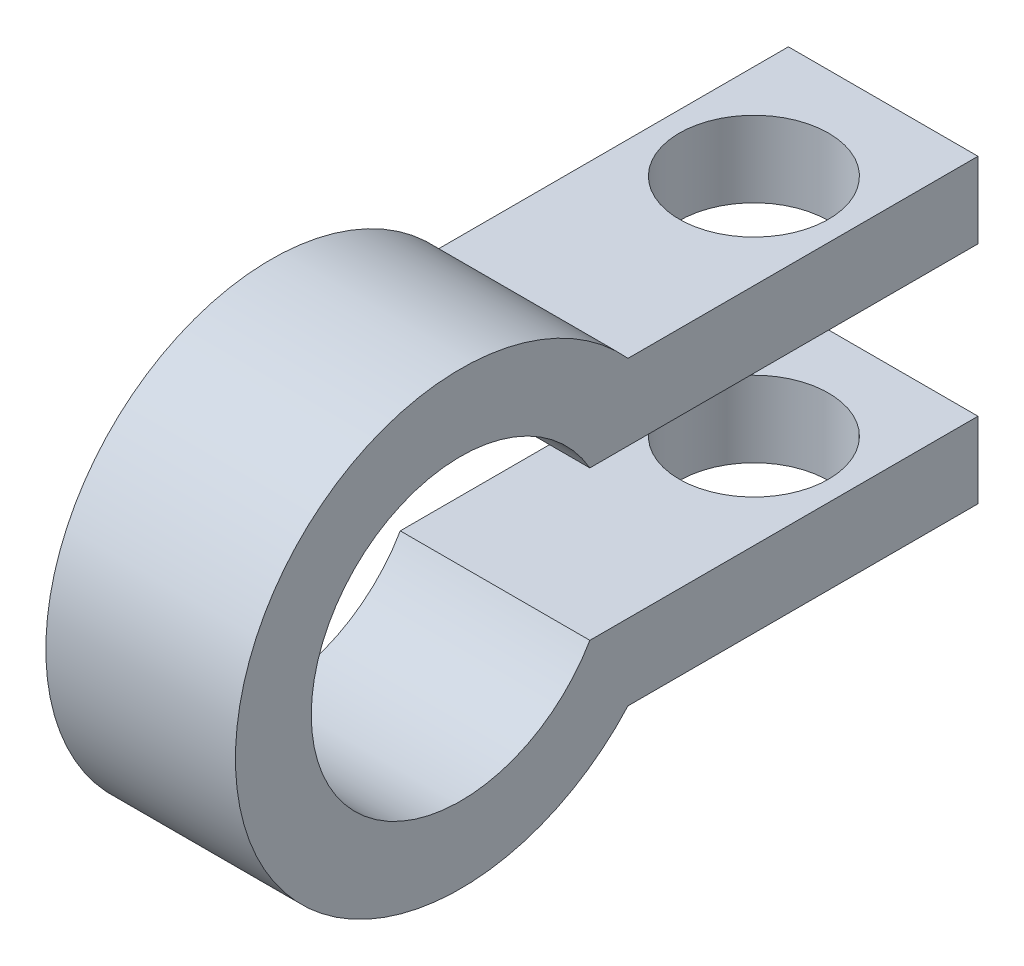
ISO-10303-21;
HEADER;
FILE_DESCRIPTION(('STEP AP214'),'2;1');
FILE_NAME('part.step','',(''),(''),'','','');
FILE_SCHEMA(('AUTOMOTIVE_DESIGN { 1 0 10303 214 1 1 1 1 }'));
ENDSEC;
DATA;
#1=APPLICATION_CONTEXT('core data for automotive mechanical design processes');
#2=APPLICATION_PROTOCOL_DEFINITION('international standard','automotive_design',2000,#1);
#3=PRODUCT_CONTEXT('',#1,'mechanical');
#4=PRODUCT('Part','Part','',(#3));
#5=PRODUCT_RELATED_PRODUCT_CATEGORY('part','',(#4));
#6=PRODUCT_DEFINITION_FORMATION('','',#4);
#7=PRODUCT_DEFINITION_CONTEXT('part definition',#1,'design');
#8=PRODUCT_DEFINITION('design','',#6,#7);
#9=PRODUCT_DEFINITION_SHAPE('','',#8);
#10=(LENGTH_UNIT() NAMED_UNIT(*) SI_UNIT(.MILLI.,.METRE.));
#11=(NAMED_UNIT(*) PLANE_ANGLE_UNIT() SI_UNIT($,.RADIAN.));
#12=(NAMED_UNIT(*) SI_UNIT($,.STERADIAN.) SOLID_ANGLE_UNIT());
#13=UNCERTAINTY_MEASURE_WITH_UNIT(LENGTH_MEASURE(1.E-05),#10,'distance_accuracy_value','');
#14=(GEOMETRIC_REPRESENTATION_CONTEXT(3) GLOBAL_UNCERTAINTY_ASSIGNED_CONTEXT((#13)) GLOBAL_UNIT_ASSIGNED_CONTEXT((#10,
#11,#12)) REPRESENTATION_CONTEXT('',''));
#15=CARTESIAN_POINT('',(0.,0.,0.));
#16=DIRECTION('',(0.,0.,1.));
#17=DIRECTION('',(1.,0.,0.));
#18=AXIS2_PLACEMENT_3D('',#15,#16,#17);
#19=CARTESIAN_POINT('',(3.175,-5.04,-4.33012701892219));
#20=DIRECTION('',(0.,1.,0.));
#21=DIRECTION('',(0.,0.,1.));
#22=AXIS2_PLACEMENT_3D('',#19,#20,#21);
#23=PLANE('',#22);
#24=CARTESIAN_POINT('',(0.,-5.04,-13.));
#25=DIRECTION('',(0.,1.,0.));
#26=DIRECTION('',(0.,0.,1.));
#27=AXIS2_PLACEMENT_3D('',#24,#25,#26);
#28=CIRCLE('',#27,2.5);
#29=CARTESIAN_POINT('',(0.,-5.04,-10.5));
#30=VERTEX_POINT('',#29);
#31=EDGE_CURVE('E134',#30,#30,#28,.T.);
#32=ORIENTED_EDGE('',*,*,#31,.T.);
#33=EDGE_LOOP('',(#32));
#34=FACE_BOUND('',#33,.T.);
#35=DIRECTION('',(0.,0.,-1.));
#36=VECTOR('',#35,1.);
#37=CARTESIAN_POINT('',(-3.175,-5.04,-4.33012701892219));
#38=LINE('',#37,#36);
#39=CARTESIAN_POINT('',(-3.175,-5.04,-5.60802995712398));
#40=VERTEX_POINT('',#39);
#41=CARTESIAN_POINT('',(-3.175,-5.04,-17.3301270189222));
#42=VERTEX_POINT('',#41);
#43=EDGE_CURVE('E130',#40,#42,#38,.T.);
#44=ORIENTED_EDGE('',*,*,#43,.T.);
#45=DIRECTION('',(-1.,0.,0.));
#46=VECTOR('',#45,1.);
#47=CARTESIAN_POINT('',(3.175,-5.04,-17.3301270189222));
#48=LINE('',#47,#46);
#49=CARTESIAN_POINT('',(3.175,-5.04,-17.3301270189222));
#50=VERTEX_POINT('',#49);
#51=EDGE_CURVE('E11',#50,#42,#48,.T.);
#52=ORIENTED_EDGE('',*,*,#51,.F.);
#53=DIRECTION('',(0.,0.,-1.));
#54=VECTOR('',#53,1.);
#55=CARTESIAN_POINT('',(3.175,-5.04,-4.33012701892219));
#56=LINE('',#55,#54);
#57=CARTESIAN_POINT('',(3.175,-5.04,-5.60802995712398));
#58=VERTEX_POINT('',#57);
#59=EDGE_CURVE('E88',#58,#50,#56,.T.);
#60=ORIENTED_EDGE('',*,*,#59,.F.);
#61=DIRECTION('',(-1.,0.,0.));
#62=VECTOR('',#61,1.);
#63=CARTESIAN_POINT('',(3.175,-5.04,-5.60802995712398));
#64=LINE('',#63,#62);
#65=EDGE_CURVE('E129',#58,#40,#64,.T.);
#66=ORIENTED_EDGE('',*,*,#65,.T.);
#67=EDGE_LOOP('',(#44,#52,#60,#66));
#68=FACE_BOUND('',#67,.T.);
#69=ADVANCED_FACE('F32',(#34,#68),#23,.F.);
#70=CARTESIAN_POINT('',(3.175,-2.5,-17.3301270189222));
#71=DIRECTION('',(0.,0.,-1.));
#72=DIRECTION('',(-1.,0.,0.));
#73=AXIS2_PLACEMENT_3D('',#70,#71,#72);
#74=PLANE('',#73);
#75=DIRECTION('',(0.,-1.,0.));
#76=VECTOR('',#75,1.);
#77=CARTESIAN_POINT('',(-3.175,-2.5,-17.3301270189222));
#78=LINE('',#77,#76);
#79=CARTESIAN_POINT('',(-3.175,-2.5,-17.3301270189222));
#80=VERTEX_POINT('',#79);
#81=EDGE_CURVE('E133',#80,#42,#78,.T.);
#82=ORIENTED_EDGE('',*,*,#81,.F.);
#83=DIRECTION('',(-1.,0.,0.));
#84=VECTOR('',#83,1.);
#85=CARTESIAN_POINT('',(3.175,-2.5,-17.3301270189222));
#86=LINE('',#85,#84);
#87=CARTESIAN_POINT('',(3.175,-2.5,-17.3301270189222));
#88=VERTEX_POINT('',#87);
#89=EDGE_CURVE('E41',#88,#80,#86,.T.);
#90=ORIENTED_EDGE('',*,*,#89,.F.);
#91=DIRECTION('',(0.,-1.,0.));
#92=VECTOR('',#91,1.);
#93=CARTESIAN_POINT('',(3.175,-2.5,-17.3301270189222));
#94=LINE('',#93,#92);
#95=EDGE_CURVE('E174',#88,#50,#94,.T.);
#96=ORIENTED_EDGE('',*,*,#95,.T.);
#97=ORIENTED_EDGE('',*,*,#51,.T.);
#98=EDGE_LOOP('',(#82,#90,#96,#97));
#99=FACE_BOUND('',#98,.T.);
#100=ADVANCED_FACE('F165',(#99),#74,.T.);
#101=CARTESIAN_POINT('',(3.175,-2.5,-4.33012701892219));
#102=DIRECTION('',(0.,1.,0.));
#103=DIRECTION('',(0.,0.,1.));
#104=AXIS2_PLACEMENT_3D('',#101,#102,#103);
#105=PLANE('',#104);
#106=CARTESIAN_POINT('',(0.,-2.5,-13.));
#107=DIRECTION('',(0.,1.,0.));
#108=DIRECTION('',(0.,0.,1.));
#109=AXIS2_PLACEMENT_3D('',#106,#107,#108);
#110=CIRCLE('',#109,2.5);
#111=CARTESIAN_POINT('',(0.,-2.5,-10.5));
#112=VERTEX_POINT('',#111);
#113=EDGE_CURVE('E181',#112,#112,#110,.T.);
#114=ORIENTED_EDGE('',*,*,#113,.F.);
#115=EDGE_LOOP('',(#114));
#116=FACE_BOUND('',#115,.T.);
#117=DIRECTION('',(0.,0.,-1.));
#118=VECTOR('',#117,1.);
#119=CARTESIAN_POINT('',(-3.175,-2.5,-4.33012701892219));
#120=LINE('',#119,#118);
#121=CARTESIAN_POINT('',(-3.175,-2.5,-4.33012701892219));
#122=VERTEX_POINT('',#121);
#123=EDGE_CURVE('E137',#122,#80,#120,.T.);
#124=ORIENTED_EDGE('',*,*,#123,.F.);
#125=DIRECTION('',(-1.,0.,0.));
#126=VECTOR('',#125,1.);
#127=CARTESIAN_POINT('',(3.175,-2.5,-4.33012701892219));
#128=LINE('',#127,#126);
#129=CARTESIAN_POINT('',(3.175,-2.5,-4.33012701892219));
#130=VERTEX_POINT('',#129);
#131=EDGE_CURVE('E154',#130,#122,#128,.T.);
#132=ORIENTED_EDGE('',*,*,#131,.F.);
#133=DIRECTION('',(0.,0.,-1.));
#134=VECTOR('',#133,1.);
#135=CARTESIAN_POINT('',(3.175,-2.5,-4.33012701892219));
#136=LINE('',#135,#134);
#137=EDGE_CURVE('E162',#130,#88,#136,.T.);
#138=ORIENTED_EDGE('',*,*,#137,.T.);
#139=ORIENTED_EDGE('',*,*,#89,.T.);
#140=EDGE_LOOP('',(#124,#132,#138,#139));
#141=FACE_BOUND('',#140,.T.);
#142=ADVANCED_FACE('F160',(#116,#141),#105,.T.);
#143=CARTESIAN_POINT('',(3.175,0.,0.));
#144=DIRECTION('',(-1.,0.,0.));
#145=DIRECTION('',(0.,0.,1.));
#146=AXIS2_PLACEMENT_3D('',#143,#144,#145);
#147=CYLINDRICAL_SURFACE('',#146,5.);
#148=CARTESIAN_POINT('',(-3.175,0.,0.));
#149=DIRECTION('',(1.,0.,0.));
#150=DIRECTION('',(0.,0.,-1.));
#151=AXIS2_PLACEMENT_3D('',#148,#149,#150);
#152=CIRCLE('',#151,5.);
#153=CARTESIAN_POINT('',(-3.175,2.5,-4.33012701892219));
#154=VERTEX_POINT('',#153);
#155=EDGE_CURVE('E140',#154,#122,#152,.T.);
#156=ORIENTED_EDGE('',*,*,#155,.F.);
#157=DIRECTION('',(-1.,0.,0.));
#158=VECTOR('',#157,1.);
#159=CARTESIAN_POINT('',(3.175,2.5,-4.33012701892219));
#160=LINE('',#159,#158);
#161=CARTESIAN_POINT('',(3.175,2.5,-4.33012701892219));
#162=VERTEX_POINT('',#161);
#163=EDGE_CURVE('E152',#162,#154,#160,.T.);
#164=ORIENTED_EDGE('',*,*,#163,.F.);
#165=CARTESIAN_POINT('',(3.175,0.,0.));
#166=DIRECTION('',(1.,0.,0.));
#167=DIRECTION('',(0.,0.,-1.));
#168=AXIS2_PLACEMENT_3D('',#165,#166,#167);
#169=CIRCLE('',#168,5.);
#170=EDGE_CURVE('E124',#162,#130,#169,.T.);
#171=ORIENTED_EDGE('',*,*,#170,.T.);
#172=ORIENTED_EDGE('',*,*,#131,.T.);
#173=EDGE_LOOP('',(#156,#164,#171,#172));
#174=FACE_BOUND('',#173,.T.);
#175=ADVANCED_FACE('F172',(#174),#147,.F.);
#176=CARTESIAN_POINT('',(3.175,2.5,-4.33012701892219));
#177=DIRECTION('',(0.,-1.,0.));
#178=DIRECTION('',(0.,0.,-1.));
#179=AXIS2_PLACEMENT_3D('',#176,#177,#178);
#180=PLANE('',#179);
#181=CARTESIAN_POINT('',(0.,2.5,-13.));
#182=DIRECTION('',(0.,-1.,0.));
#183=DIRECTION('',(0.,0.,-1.));
#184=AXIS2_PLACEMENT_3D('',#181,#182,#183);
#185=CIRCLE('',#184,2.5);
#186=CARTESIAN_POINT('',(0.,2.5,-15.5));
#187=VERTEX_POINT('',#186);
#188=EDGE_CURVE('E184',#187,#187,#185,.T.);
#189=ORIENTED_EDGE('',*,*,#188,.F.);
#190=EDGE_LOOP('',(#189));
#191=FACE_BOUND('',#190,.T.);
#192=DIRECTION('',(0.,0.,1.));
#193=VECTOR('',#192,1.);
#194=CARTESIAN_POINT('',(-3.175,2.5,-4.33012701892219));
#195=LINE('',#194,#193);
#196=CARTESIAN_POINT('',(-3.175,2.5,-17.3301270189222));
#197=VERTEX_POINT('',#196);
#198=EDGE_CURVE('E143',#197,#154,#195,.T.);
#199=ORIENTED_EDGE('',*,*,#198,.F.);
#200=DIRECTION('',(-1.,0.,0.));
#201=VECTOR('',#200,1.);
#202=CARTESIAN_POINT('',(3.175,2.5,-17.3301270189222));
#203=LINE('',#202,#201);
#204=CARTESIAN_POINT('',(3.175,2.5,-17.3301270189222));
#205=VERTEX_POINT('',#204);
#206=EDGE_CURVE('E112',#205,#197,#203,.T.);
#207=ORIENTED_EDGE('',*,*,#206,.F.);
#208=DIRECTION('',(0.,0.,1.));
#209=VECTOR('',#208,1.);
#210=CARTESIAN_POINT('',(3.175,2.5,-4.33012701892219));
#211=LINE('',#210,#209);
#212=EDGE_CURVE('E122',#205,#162,#211,.T.);
#213=ORIENTED_EDGE('',*,*,#212,.T.);
#214=ORIENTED_EDGE('',*,*,#163,.T.);
#215=EDGE_LOOP('',(#199,#207,#213,#214));
#216=FACE_BOUND('',#215,.T.);
#217=ADVANCED_FACE('F221',(#191,#216),#180,.T.);
#218=CARTESIAN_POINT('',(3.175,5.04,-17.3301270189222));
#219=DIRECTION('',(0.,0.,-1.));
#220=DIRECTION('',(-1.,0.,0.));
#221=AXIS2_PLACEMENT_3D('',#218,#219,#220);
#222=PLANE('',#221);
#223=DIRECTION('',(0.,-1.,0.));
#224=VECTOR('',#223,1.);
#225=CARTESIAN_POINT('',(-3.175,5.04,-17.3301270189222));
#226=LINE('',#225,#224);
#227=CARTESIAN_POINT('',(-3.175,5.04,-17.3301270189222));
#228=VERTEX_POINT('',#227);
#229=EDGE_CURVE('E111',#228,#197,#226,.T.);
#230=ORIENTED_EDGE('',*,*,#229,.F.);
#231=DIRECTION('',(-1.,0.,0.));
#232=VECTOR('',#231,1.);
#233=CARTESIAN_POINT('',(3.175,5.04,-17.3301270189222));
#234=LINE('',#233,#232);
#235=CARTESIAN_POINT('',(3.175,5.04,-17.3301270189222));
#236=VERTEX_POINT('',#235);
#237=EDGE_CURVE('E105',#236,#228,#234,.T.);
#238=ORIENTED_EDGE('',*,*,#237,.F.);
#239=DIRECTION('',(0.,-1.,0.));
#240=VECTOR('',#239,1.);
#241=CARTESIAN_POINT('',(3.175,5.04,-17.3301270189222));
#242=LINE('',#241,#240);
#243=EDGE_CURVE('E109',#236,#205,#242,.T.);
#244=ORIENTED_EDGE('',*,*,#243,.T.);
#245=ORIENTED_EDGE('',*,*,#206,.T.);
#246=EDGE_LOOP('',(#230,#238,#244,#245));
#247=FACE_BOUND('',#246,.T.);
#248=ADVANCED_FACE('F107',(#247),#222,.T.);
#249=CARTESIAN_POINT('',(3.175,5.04,-4.33012701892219));
#250=DIRECTION('',(0.,-1.,0.));
#251=DIRECTION('',(0.,0.,-1.));
#252=AXIS2_PLACEMENT_3D('',#249,#250,#251);
#253=PLANE('',#252);
#254=CARTESIAN_POINT('',(0.,5.04,-13.));
#255=DIRECTION('',(0.,-1.,0.));
#256=DIRECTION('',(0.,0.,-1.));
#257=AXIS2_PLACEMENT_3D('',#254,#255,#256);
#258=CIRCLE('',#257,2.5);
#259=CARTESIAN_POINT('',(0.,5.04,-15.5));
#260=VERTEX_POINT('',#259);
#261=EDGE_CURVE('E35',#260,#260,#258,.T.);
#262=ORIENTED_EDGE('',*,*,#261,.T.);
#263=EDGE_LOOP('',(#262));
#264=FACE_BOUND('',#263,.T.);
#265=DIRECTION('',(0.,0.,-1.));
#266=VECTOR('',#265,1.);
#267=CARTESIAN_POINT('',(-3.175,5.04,-4.33012701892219));
#268=LINE('',#267,#266);
#269=CARTESIAN_POINT('',(-3.175,5.04,-5.60802995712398));
#270=VERTEX_POINT('',#269);
#271=EDGE_CURVE('E76',#228,#270,#268,.F.);
#272=ORIENTED_EDGE('',*,*,#271,.T.);
#273=DIRECTION('',(-1.,0.,0.));
#274=VECTOR('',#273,1.);
#275=CARTESIAN_POINT('',(3.175,5.04,-5.60802995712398));
#276=LINE('',#275,#274);
#277=CARTESIAN_POINT('',(3.175,5.04,-5.60802995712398));
#278=VERTEX_POINT('',#277);
#279=EDGE_CURVE('E113',#278,#270,#276,.T.);
#280=ORIENTED_EDGE('',*,*,#279,.F.);
#281=DIRECTION('',(0.,0.,-1.));
#282=VECTOR('',#281,1.);
#283=CARTESIAN_POINT('',(3.175,5.04,-4.33012701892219));
#284=LINE('',#283,#282);
#285=EDGE_CURVE('E115',#236,#278,#284,.F.);
#286=ORIENTED_EDGE('',*,*,#285,.F.);
#287=ORIENTED_EDGE('',*,*,#237,.T.);
#288=EDGE_LOOP('',(#272,#280,#286,#287));
#289=FACE_BOUND('',#288,.T.);
#290=ADVANCED_FACE('F116',(#264,#289),#253,.F.);
#291=CARTESIAN_POINT('',(3.175,0.,0.));
#292=DIRECTION('',(-1.,0.,0.));
#293=DIRECTION('',(0.,0.,1.));
#294=AXIS2_PLACEMENT_3D('',#291,#292,#293);
#295=CYLINDRICAL_SURFACE('',#294,7.54);
#296=CARTESIAN_POINT('',(-3.175,0.,0.));
#297=DIRECTION('',(1.,0.,0.));
#298=DIRECTION('',(0.,0.,-1.));
#299=AXIS2_PLACEMENT_3D('',#296,#297,#298);
#300=CIRCLE('',#299,7.54);
#301=EDGE_CURVE('E82',#270,#40,#300,.T.);
#302=ORIENTED_EDGE('',*,*,#301,.T.);
#303=ORIENTED_EDGE('',*,*,#65,.F.);
#304=CARTESIAN_POINT('',(3.175,0.,0.));
#305=DIRECTION('',(1.,0.,0.));
#306=DIRECTION('',(0.,0.,-1.));
#307=AXIS2_PLACEMENT_3D('',#304,#305,#306);
#308=CIRCLE('',#307,7.54);
#309=EDGE_CURVE('E49',#278,#58,#308,.T.);
#310=ORIENTED_EDGE('',*,*,#309,.F.);
#311=ORIENTED_EDGE('',*,*,#279,.T.);
#312=EDGE_LOOP('',(#302,#303,#310,#311));
#313=FACE_BOUND('',#312,.T.);
#314=ADVANCED_FACE('F210',(#313),#295,.T.);
#315=CARTESIAN_POINT('',(3.175,0.,0.));
#316=DIRECTION('',(1.,0.,0.));
#317=DIRECTION('',(0.,0.,-1.));
#318=AXIS2_PLACEMENT_3D('',#315,#316,#317);
#319=PLANE('',#318);
#320=ORIENTED_EDGE('',*,*,#59,.T.);
#321=ORIENTED_EDGE('',*,*,#95,.F.);
#322=ORIENTED_EDGE('',*,*,#137,.F.);
#323=ORIENTED_EDGE('',*,*,#170,.F.);
#324=ORIENTED_EDGE('',*,*,#212,.F.);
#325=ORIENTED_EDGE('',*,*,#243,.F.);
#326=ORIENTED_EDGE('',*,*,#285,.T.);
#327=ORIENTED_EDGE('',*,*,#309,.T.);
#328=EDGE_LOOP('',(#320,#321,#322,#323,#324,#325,#326,#327));
#329=FACE_BOUND('',#328,.T.);
#330=ADVANCED_FACE('F119',(#329),#319,.T.);
#331=CARTESIAN_POINT('',(-3.175,0.,0.));
#332=DIRECTION('',(1.,0.,0.));
#333=DIRECTION('',(0.,0.,-1.));
#334=AXIS2_PLACEMENT_3D('',#331,#332,#333);
#335=PLANE('',#334);
#336=ORIENTED_EDGE('',*,*,#43,.F.);
#337=ORIENTED_EDGE('',*,*,#301,.F.);
#338=ORIENTED_EDGE('',*,*,#271,.F.);
#339=ORIENTED_EDGE('',*,*,#229,.T.);
#340=ORIENTED_EDGE('',*,*,#198,.T.);
#341=ORIENTED_EDGE('',*,*,#155,.T.);
#342=ORIENTED_EDGE('',*,*,#123,.T.);
#343=ORIENTED_EDGE('',*,*,#81,.T.);
#344=EDGE_LOOP('',(#336,#337,#338,#339,#340,#341,#342,#343));
#345=FACE_BOUND('',#344,.T.);
#346=ADVANCED_FACE('F168',(#345),#335,.F.);
#347=CARTESIAN_POINT('',(0.,-7.54,-13.));
#348=DIRECTION('',(0.,1.,0.));
#349=DIRECTION('',(0.,0.,1.));
#350=AXIS2_PLACEMENT_3D('',#347,#348,#349);
#351=CYLINDRICAL_SURFACE('',#350,2.5);
#352=ORIENTED_EDGE('',*,*,#188,.T.);
#353=EDGE_LOOP('',(#352));
#354=FACE_BOUND('',#353,.T.);
#355=ORIENTED_EDGE('',*,*,#261,.F.);
#356=EDGE_LOOP('',(#355));
#357=FACE_BOUND('',#356,.T.);
#358=ADVANCED_FACE('F192',(#354,#357),#351,.F.);
#359=ORIENTED_EDGE('',*,*,#113,.T.);
#360=EDGE_LOOP('',(#359));
#361=FACE_BOUND('',#360,.T.);
#362=ORIENTED_EDGE('',*,*,#31,.F.);
#363=EDGE_LOOP('',(#362));
#364=FACE_BOUND('',#363,.T.);
#365=ADVANCED_FACE('F194',(#361,#364),#351,.F.);
#366=CLOSED_SHELL('',(#69,#100,#142,#175,#217,#248,#290,#314,#330,#346,#358,#365));
#367=MANIFOLD_SOLID_BREP('B2',#366);
#368=ADVANCED_BREP_SHAPE_REPRESENTATION('',(#18,#367),#14);
#369=SHAPE_DEFINITION_REPRESENTATION(#9,#368);
ENDSEC;
END-ISO-10303-21;
